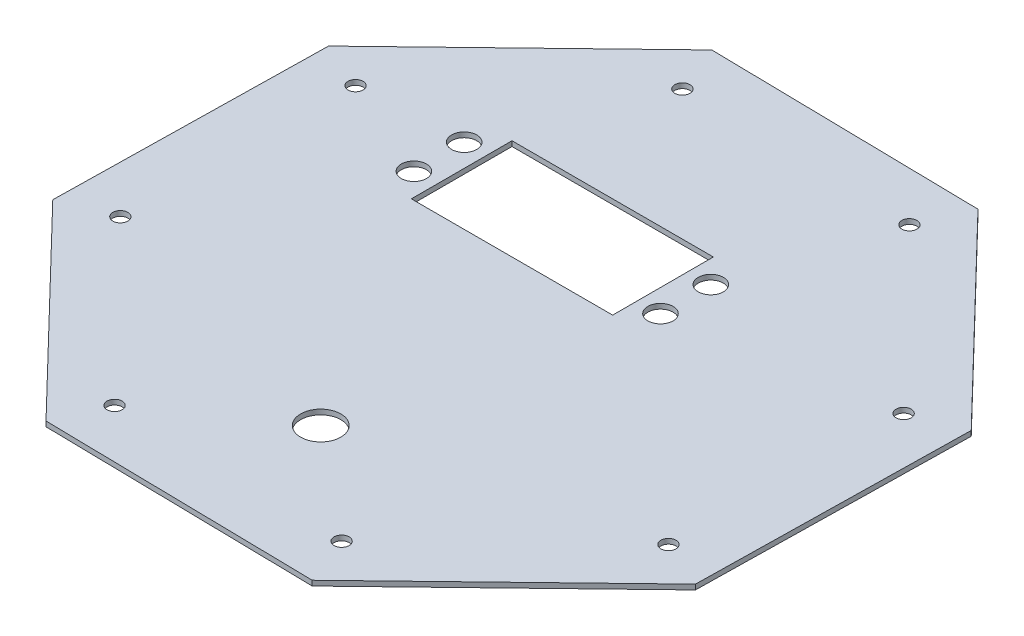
ISO-10303-21;
HEADER;
FILE_DESCRIPTION(('STEP AP214'),'2;1');
FILE_NAME('part.step','',(''),(''),'','','');
FILE_SCHEMA(('AUTOMOTIVE_DESIGN { 1 0 10303 214 1 1 1 1 }'));
ENDSEC;
DATA;
#1=APPLICATION_CONTEXT('core data for automotive mechanical design processes');
#2=APPLICATION_PROTOCOL_DEFINITION('international standard','automotive_design',2000,#1);
#3=PRODUCT_CONTEXT('',#1,'mechanical');
#4=PRODUCT('Part','Part','',(#3));
#5=PRODUCT_RELATED_PRODUCT_CATEGORY('part','',(#4));
#6=PRODUCT_DEFINITION_FORMATION('','',#4);
#7=PRODUCT_DEFINITION_CONTEXT('part definition',#1,'design');
#8=PRODUCT_DEFINITION('design','',#6,#7);
#9=PRODUCT_DEFINITION_SHAPE('','',#8);
#10=(LENGTH_UNIT() NAMED_UNIT(*) SI_UNIT(.MILLI.,.METRE.));
#11=(NAMED_UNIT(*) PLANE_ANGLE_UNIT() SI_UNIT($,.RADIAN.));
#12=(NAMED_UNIT(*) SI_UNIT($,.STERADIAN.) SOLID_ANGLE_UNIT());
#13=UNCERTAINTY_MEASURE_WITH_UNIT(LENGTH_MEASURE(1.E-05),#10,'distance_accuracy_value','');
#14=(GEOMETRIC_REPRESENTATION_CONTEXT(3) GLOBAL_UNCERTAINTY_ASSIGNED_CONTEXT((#13)) GLOBAL_UNIT_ASSIGNED_CONTEXT((#10,
#11,#12)) REPRESENTATION_CONTEXT('',''));
#15=CARTESIAN_POINT('',(0.,0.,0.));
#16=DIRECTION('',(0.,0.,1.));
#17=DIRECTION('',(1.,0.,0.));
#18=AXIS2_PLACEMENT_3D('',#15,#16,#17);
#19=CARTESIAN_POINT('',(0.,1.,0.));
#20=DIRECTION('',(0.,1.,0.));
#21=DIRECTION('',(0.,0.,1.));
#22=AXIS2_PLACEMENT_3D('',#19,#20,#21);
#23=PLANE('',#22);
#24=CARTESIAN_POINT('',(-34.5,1.,-15.));
#25=DIRECTION('',(0.,1.,0.));
#26=DIRECTION('',(0.,0.,1.));
#27=AXIS2_PLACEMENT_3D('',#24,#25,#26);
#28=CIRCLE('',#27,2.5);
#29=CARTESIAN_POINT('',(-34.5,1.,-12.5));
#30=VERTEX_POINT('',#29);
#31=EDGE_CURVE('E565',#30,#30,#28,.T.);
#32=ORIENTED_EDGE('',*,*,#31,.F.);
#33=EDGE_LOOP('',(#32));
#34=FACE_BOUND('',#33,.T.);
#35=CARTESIAN_POINT('',(14.5,1.,-25.));
#36=DIRECTION('',(0.,1.,0.));
#37=DIRECTION('',(0.,0.,1.));
#38=AXIS2_PLACEMENT_3D('',#35,#36,#37);
#39=CIRCLE('',#38,2.5);
#40=CARTESIAN_POINT('',(14.5,1.,-22.5));
#41=VERTEX_POINT('',#40);
#42=EDGE_CURVE('E563',#41,#41,#39,.T.);
#43=ORIENTED_EDGE('',*,*,#42,.F.);
#44=EDGE_LOOP('',(#43));
#45=FACE_BOUND('',#44,.T.);
#46=DIRECTION('',(0.,0.,-1.));
#47=VECTOR('',#46,1.);
#48=CARTESIAN_POINT('',(10.,1.,-10.));
#49=LINE('',#48,#47);
#50=CARTESIAN_POINT('',(10.,1.,-10.));
#51=VERTEX_POINT('',#50);
#52=CARTESIAN_POINT('',(10.,1.,-30.));
#53=VERTEX_POINT('',#52);
#54=EDGE_CURVE('E50',#51,#53,#49,.T.);
#55=ORIENTED_EDGE('',*,*,#54,.F.);
#56=DIRECTION('',(1.,0.,0.));
#57=VECTOR('',#56,1.);
#58=CARTESIAN_POINT('',(-30.,1.,-9.99999999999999));
#59=LINE('',#58,#57);
#60=CARTESIAN_POINT('',(-30.,1.,-9.99999999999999));
#61=VERTEX_POINT('',#60);
#62=EDGE_CURVE('E142',#61,#51,#59,.T.);
#63=ORIENTED_EDGE('',*,*,#62,.F.);
#64=DIRECTION('',(0.,0.,1.));
#65=VECTOR('',#64,1.);
#66=CARTESIAN_POINT('',(-30.,1.,-9.99999999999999));
#67=LINE('',#66,#65);
#68=CARTESIAN_POINT('',(-30.,1.,-30.));
#69=VERTEX_POINT('',#68);
#70=EDGE_CURVE('E127',#69,#61,#67,.T.);
#71=ORIENTED_EDGE('',*,*,#70,.F.);
#72=DIRECTION('',(-1.,0.,0.));
#73=VECTOR('',#72,1.);
#74=CARTESIAN_POINT('',(-30.,1.,-30.));
#75=LINE('',#74,#73);
#76=EDGE_CURVE('E136',#53,#69,#75,.T.);
#77=ORIENTED_EDGE('',*,*,#76,.F.);
#78=EDGE_LOOP('',(#55,#63,#71,#77));
#79=FACE_BOUND('',#78,.T.);
#80=CARTESIAN_POINT('',(0.,1.,38.));
#81=DIRECTION('',(0.,1.,0.));
#82=DIRECTION('',(0.,0.,1.));
#83=AXIS2_PLACEMENT_3D('',#80,#81,#82);
#84=CIRCLE('',#83,4.);
#85=CARTESIAN_POINT('',(0.,1.,42.));
#86=VERTEX_POINT('',#85);
#87=EDGE_CURVE('E149',#86,#86,#84,.T.);
#88=ORIENTED_EDGE('',*,*,#87,.F.);
#89=EDGE_LOOP('',(#88));
#90=FACE_BOUND('',#89,.T.);
#91=CARTESIAN_POINT('',(-34.5,1.,-25.));
#92=DIRECTION('',(0.,1.,0.));
#93=DIRECTION('',(0.,0.,1.));
#94=AXIS2_PLACEMENT_3D('',#91,#92,#93);
#95=CIRCLE('',#94,2.5);
#96=CARTESIAN_POINT('',(-34.5,1.,-22.5));
#97=VERTEX_POINT('',#96);
#98=EDGE_CURVE('E570',#97,#97,#95,.T.);
#99=ORIENTED_EDGE('',*,*,#98,.F.);
#100=EDGE_LOOP('',(#99));
#101=FACE_BOUND('',#100,.T.);
#102=CARTESIAN_POINT('',(14.5,1.,-15.));
#103=DIRECTION('',(0.,1.,0.));
#104=DIRECTION('',(0.,0.,1.));
#105=AXIS2_PLACEMENT_3D('',#102,#103,#104);
#106=CIRCLE('',#105,2.5);
#107=CARTESIAN_POINT('',(14.5,1.,-12.5));
#108=VERTEX_POINT('',#107);
#109=EDGE_CURVE('E152',#108,#108,#106,.T.);
#110=ORIENTED_EDGE('',*,*,#109,.F.);
#111=EDGE_LOOP('',(#110));
#112=FACE_BOUND('',#111,.T.);
#113=CARTESIAN_POINT('',(21.9771472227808,1.,55.8301441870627));
#114=DIRECTION('',(0.,1.,0.));
#115=DIRECTION('',(0.,0.,1.));
#116=AXIS2_PLACEMENT_3D('',#113,#114,#115);
#117=CIRCLE('',#116,1.5);
#118=CARTESIAN_POINT('',(21.9771472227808,1.,57.3301441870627));
#119=VERTEX_POINT('',#118);
#120=EDGE_CURVE('E163',#119,#119,#117,.T.);
#121=ORIENTED_EDGE('',*,*,#120,.F.);
#122=EDGE_LOOP('',(#121));
#123=FACE_BOUND('',#122,.T.);
#124=CARTESIAN_POINT('',(55.8301441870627,1.,-21.9771472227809));
#125=DIRECTION('',(0.,1.,0.));
#126=DIRECTION('',(0.,0.,1.));
#127=AXIS2_PLACEMENT_3D('',#124,#125,#126);
#128=CIRCLE('',#127,1.5);
#129=CARTESIAN_POINT('',(55.8301441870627,1.,-20.4771472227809));
#130=VERTEX_POINT('',#129);
#131=EDGE_CURVE('E175',#130,#130,#128,.T.);
#132=ORIENTED_EDGE('',*,*,#131,.F.);
#133=EDGE_LOOP('',(#132));
#134=FACE_BOUND('',#133,.T.);
#135=CARTESIAN_POINT('',(-21.9771472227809,1.,-55.8301441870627));
#136=DIRECTION('',(0.,1.,0.));
#137=DIRECTION('',(0.,0.,1.));
#138=AXIS2_PLACEMENT_3D('',#135,#136,#137);
#139=CIRCLE('',#138,1.5);
#140=CARTESIAN_POINT('',(-21.9771472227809,1.,-54.3301441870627));
#141=VERTEX_POINT('',#140);
#142=EDGE_CURVE('E187',#141,#141,#139,.T.);
#143=ORIENTED_EDGE('',*,*,#142,.F.);
#144=EDGE_LOOP('',(#143));
#145=FACE_BOUND('',#144,.T.);
#146=CARTESIAN_POINT('',(-55.8301441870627,1.,21.9771472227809));
#147=DIRECTION('',(0.,1.,0.));
#148=DIRECTION('',(0.,0.,1.));
#149=AXIS2_PLACEMENT_3D('',#146,#147,#148);
#150=CIRCLE('',#149,1.5);
#151=CARTESIAN_POINT('',(-55.8301441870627,1.,23.4771472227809));
#152=VERTEX_POINT('',#151);
#153=EDGE_CURVE('E199',#152,#152,#150,.T.);
#154=ORIENTED_EDGE('',*,*,#153,.F.);
#155=EDGE_LOOP('',(#154));
#156=FACE_BOUND('',#155,.T.);
#157=DIRECTION('',(0.999843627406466,0.,0.017683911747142));
#158=VECTOR('',#157,1.);
#159=CARTESIAN_POINT('',(-28.0691256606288,1.,64.5137162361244));
#160=LINE('',#159,#158);
#161=CARTESIAN_POINT('',(-28.0691256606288,1.,64.5137162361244));
#162=VERTEX_POINT('',#161);
#163=CARTESIAN_POINT('',(25.7702171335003,1.,65.4659553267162));
#164=VERTEX_POINT('',#163);
#165=EDGE_CURVE('E205',#162,#164,#160,.T.);
#166=ORIENTED_EDGE('',*,*,#165,.T.);
#167=DIRECTION('',(0.719500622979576,0.,-0.694491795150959));
#168=VECTOR('',#167,1.);
#169=CARTESIAN_POINT('',(25.7702171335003,1.,65.4659553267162));
#170=LINE('',#169,#168);
#171=CARTESIAN_POINT('',(64.5137162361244,1.,28.0691256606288));
#172=VERTEX_POINT('',#171);
#173=EDGE_CURVE('E208',#164,#172,#170,.T.);
#174=ORIENTED_EDGE('',*,*,#173,.T.);
#175=DIRECTION('',(0.017683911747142,0.,-0.999843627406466));
#176=VECTOR('',#175,1.);
#177=CARTESIAN_POINT('',(64.5137162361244,1.,28.0691256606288));
#178=LINE('',#177,#176);
#179=CARTESIAN_POINT('',(65.4659553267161,1.,-25.7702171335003));
#180=VERTEX_POINT('',#179);
#181=EDGE_CURVE('E211',#172,#180,#178,.T.);
#182=ORIENTED_EDGE('',*,*,#181,.T.);
#183=DIRECTION('',(-0.694491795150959,0.,-0.719500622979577));
#184=VECTOR('',#183,1.);
#185=CARTESIAN_POINT('',(65.4659553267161,1.,-25.7702171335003));
#186=LINE('',#185,#184);
#187=CARTESIAN_POINT('',(28.0691256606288,1.,-64.5137162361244));
#188=VERTEX_POINT('',#187);
#189=EDGE_CURVE('E213',#180,#188,#186,.T.);
#190=ORIENTED_EDGE('',*,*,#189,.T.);
#191=DIRECTION('',(-0.999843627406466,0.,-0.0176839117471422));
#192=VECTOR('',#191,1.);
#193=CARTESIAN_POINT('',(28.0691256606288,1.,-64.5137162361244));
#194=LINE('',#193,#192);
#195=CARTESIAN_POINT('',(-25.7702171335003,1.,-65.4659553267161));
#196=VERTEX_POINT('',#195);
#197=EDGE_CURVE('E215',#188,#196,#194,.T.);
#198=ORIENTED_EDGE('',*,*,#197,.T.);
#199=DIRECTION('',(-0.719500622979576,0.,0.694491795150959));
#200=VECTOR('',#199,1.);
#201=CARTESIAN_POINT('',(-25.7702171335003,1.,-65.4659553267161));
#202=LINE('',#201,#200);
#203=CARTESIAN_POINT('',(-64.5137162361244,1.,-28.0691256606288));
#204=VERTEX_POINT('',#203);
#205=EDGE_CURVE('E217',#196,#204,#202,.T.);
#206=ORIENTED_EDGE('',*,*,#205,.T.);
#207=DIRECTION('',(-0.017683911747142,0.,0.999843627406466));
#208=VECTOR('',#207,1.);
#209=CARTESIAN_POINT('',(-64.5137162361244,1.,-28.0691256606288));
#210=LINE('',#209,#208);
#211=CARTESIAN_POINT('',(-65.4659553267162,1.,25.7702171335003));
#212=VERTEX_POINT('',#211);
#213=EDGE_CURVE('E219',#204,#212,#210,.T.);
#214=ORIENTED_EDGE('',*,*,#213,.T.);
#215=DIRECTION('',(0.694491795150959,0.,0.719500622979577));
#216=VECTOR('',#215,1.);
#217=CARTESIAN_POINT('',(-65.4659553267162,1.,25.7702171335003));
#218=LINE('',#217,#216);
#219=EDGE_CURVE('E221',#212,#162,#218,.T.);
#220=ORIENTED_EDGE('',*,*,#219,.T.);
#221=EDGE_LOOP('',(#166,#174,#182,#190,#198,#206,#214,#220));
#222=FACE_BOUND('',#221,.T.);
#223=CARTESIAN_POINT('',(-55.0180633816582,1.,-23.9376837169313));
#224=DIRECTION('',(0.,1.,0.));
#225=DIRECTION('',(0.,0.,1.));
#226=AXIS2_PLACEMENT_3D('',#223,#224,#225);
#227=CIRCLE('',#226,1.5);
#228=CARTESIAN_POINT('',(-55.0180633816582,1.,-22.4376837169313));
#229=VERTEX_POINT('',#228);
#230=EDGE_CURVE('E193',#229,#229,#227,.T.);
#231=ORIENTED_EDGE('',*,*,#230,.F.);
#232=EDGE_LOOP('',(#231));
#233=FACE_BOUND('',#232,.T.);
#234=CARTESIAN_POINT('',(23.9376837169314,1.,-55.0180633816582));
#235=DIRECTION('',(0.,1.,0.));
#236=DIRECTION('',(0.,0.,1.));
#237=AXIS2_PLACEMENT_3D('',#234,#235,#236);
#238=CIRCLE('',#237,1.5);
#239=CARTESIAN_POINT('',(23.9376837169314,1.,-53.5180633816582));
#240=VERTEX_POINT('',#239);
#241=EDGE_CURVE('E181',#240,#240,#238,.T.);
#242=ORIENTED_EDGE('',*,*,#241,.F.);
#243=EDGE_LOOP('',(#242));
#244=FACE_BOUND('',#243,.T.);
#245=CARTESIAN_POINT('',(55.0180633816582,1.,23.9376837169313));
#246=DIRECTION('',(0.,1.,0.));
#247=DIRECTION('',(0.,0.,1.));
#248=AXIS2_PLACEMENT_3D('',#245,#246,#247);
#249=CIRCLE('',#248,1.5);
#250=CARTESIAN_POINT('',(55.0180633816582,1.,25.4376837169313));
#251=VERTEX_POINT('',#250);
#252=EDGE_CURVE('E169',#251,#251,#249,.T.);
#253=ORIENTED_EDGE('',*,*,#252,.F.);
#254=EDGE_LOOP('',(#253));
#255=FACE_BOUND('',#254,.T.);
#256=CARTESIAN_POINT('',(-23.9376837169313,1.,55.0180633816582));
#257=DIRECTION('',(0.,1.,0.));
#258=DIRECTION('',(0.,0.,1.));
#259=AXIS2_PLACEMENT_3D('',#256,#257,#258);
#260=CIRCLE('',#259,1.5);
#261=CARTESIAN_POINT('',(-23.9376837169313,1.,56.5180633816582));
#262=VERTEX_POINT('',#261);
#263=EDGE_CURVE('E156',#262,#262,#260,.T.);
#264=ORIENTED_EDGE('',*,*,#263,.F.);
#265=EDGE_LOOP('',(#264));
#266=FACE_BOUND('',#265,.T.);
#267=ADVANCED_FACE('F33',(#34,#45,#79,#90,#101,#112,#123,#134,#145,#156,#222,#233,#244,#255,
#266),#23,.T.);
#268=CARTESIAN_POINT('',(0.,0.,0.));
#269=DIRECTION('',(0.,1.,0.));
#270=DIRECTION('',(0.,0.,1.));
#271=AXIS2_PLACEMENT_3D('',#268,#269,#270);
#272=PLANE('',#271);
#273=CARTESIAN_POINT('',(-34.5,0.,-15.));
#274=DIRECTION('',(0.,1.,0.));
#275=DIRECTION('',(0.,0.,1.));
#276=AXIS2_PLACEMENT_3D('',#273,#274,#275);
#277=CIRCLE('',#276,2.5);
#278=CARTESIAN_POINT('',(-34.5,0.,-12.5));
#279=VERTEX_POINT('',#278);
#280=EDGE_CURVE('E37',#279,#279,#277,.T.);
#281=ORIENTED_EDGE('',*,*,#280,.T.);
#282=EDGE_LOOP('',(#281));
#283=FACE_BOUND('',#282,.T.);
#284=CARTESIAN_POINT('',(14.5,0.,-25.));
#285=DIRECTION('',(0.,1.,0.));
#286=DIRECTION('',(0.,0.,1.));
#287=AXIS2_PLACEMENT_3D('',#284,#285,#286);
#288=CIRCLE('',#287,2.5);
#289=CARTESIAN_POINT('',(14.5,0.,-22.5));
#290=VERTEX_POINT('',#289);
#291=EDGE_CURVE('E271',#290,#290,#288,.T.);
#292=ORIENTED_EDGE('',*,*,#291,.T.);
#293=EDGE_LOOP('',(#292));
#294=FACE_BOUND('',#293,.T.);
#295=DIRECTION('',(1.,0.,0.));
#296=VECTOR('',#295,1.);
#297=CARTESIAN_POINT('',(0.,0.,-10.));
#298=LINE('',#297,#296);
#299=CARTESIAN_POINT('',(-30.,0.,-9.99999999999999));
#300=VERTEX_POINT('',#299);
#301=CARTESIAN_POINT('',(10.,0.,-10.));
#302=VERTEX_POINT('',#301);
#303=EDGE_CURVE('E42',#300,#302,#298,.T.);
#304=ORIENTED_EDGE('',*,*,#303,.T.);
#305=DIRECTION('',(0.,0.,-1.));
#306=VECTOR('',#305,1.);
#307=CARTESIAN_POINT('',(10.,0.,0.));
#308=LINE('',#307,#306);
#309=CARTESIAN_POINT('',(10.,0.,-30.));
#310=VERTEX_POINT('',#309);
#311=EDGE_CURVE('E11',#302,#310,#308,.T.);
#312=ORIENTED_EDGE('',*,*,#311,.T.);
#313=DIRECTION('',(-1.,0.,0.));
#314=VECTOR('',#313,1.);
#315=CARTESIAN_POINT('',(0.,0.,-30.));
#316=LINE('',#315,#314);
#317=CARTESIAN_POINT('',(-30.,0.,-30.));
#318=VERTEX_POINT('',#317);
#319=EDGE_CURVE('E262',#310,#318,#316,.T.);
#320=ORIENTED_EDGE('',*,*,#319,.T.);
#321=DIRECTION('',(0.,0.,1.));
#322=VECTOR('',#321,1.);
#323=CARTESIAN_POINT('',(-30.,0.,0.));
#324=LINE('',#323,#322);
#325=EDGE_CURVE('E130',#318,#300,#324,.T.);
#326=ORIENTED_EDGE('',*,*,#325,.T.);
#327=EDGE_LOOP('',(#304,#312,#320,#326));
#328=FACE_BOUND('',#327,.T.);
#329=CARTESIAN_POINT('',(0.,0.,38.));
#330=DIRECTION('',(0.,1.,0.));
#331=DIRECTION('',(0.,0.,1.));
#332=AXIS2_PLACEMENT_3D('',#329,#330,#331);
#333=CIRCLE('',#332,4.);
#334=CARTESIAN_POINT('',(0.,0.,42.));
#335=VERTEX_POINT('',#334);
#336=EDGE_CURVE('E268',#335,#335,#333,.T.);
#337=ORIENTED_EDGE('',*,*,#336,.T.);
#338=EDGE_LOOP('',(#337));
#339=FACE_BOUND('',#338,.T.);
#340=CARTESIAN_POINT('',(-34.5,0.,-25.));
#341=DIRECTION('',(0.,1.,0.));
#342=DIRECTION('',(0.,0.,1.));
#343=AXIS2_PLACEMENT_3D('',#340,#341,#342);
#344=CIRCLE('',#343,2.5);
#345=CARTESIAN_POINT('',(-34.5,0.,-22.5));
#346=VERTEX_POINT('',#345);
#347=EDGE_CURVE('E265',#346,#346,#344,.T.);
#348=ORIENTED_EDGE('',*,*,#347,.T.);
#349=EDGE_LOOP('',(#348));
#350=FACE_BOUND('',#349,.T.);
#351=CARTESIAN_POINT('',(14.5,0.,-15.));
#352=DIRECTION('',(0.,1.,0.));
#353=DIRECTION('',(0.,0.,1.));
#354=AXIS2_PLACEMENT_3D('',#351,#352,#353);
#355=CIRCLE('',#354,2.5);
#356=CARTESIAN_POINT('',(14.5,0.,-12.5));
#357=VERTEX_POINT('',#356);
#358=EDGE_CURVE('E155',#357,#357,#355,.T.);
#359=ORIENTED_EDGE('',*,*,#358,.T.);
#360=EDGE_LOOP('',(#359));
#361=FACE_BOUND('',#360,.T.);
#362=DIRECTION('',(0.999843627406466,0.,0.017683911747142));
#363=VECTOR('',#362,1.);
#364=CARTESIAN_POINT('',(-28.0691256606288,0.,64.5137162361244));
#365=LINE('',#364,#363);
#366=CARTESIAN_POINT('',(-28.0691256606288,0.,64.5137162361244));
#367=VERTEX_POINT('',#366);
#368=CARTESIAN_POINT('',(25.7702171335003,0.,65.4659553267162));
#369=VERTEX_POINT('',#368);
#370=EDGE_CURVE('E202',#367,#369,#365,.T.);
#371=ORIENTED_EDGE('',*,*,#370,.F.);
#372=DIRECTION('',(0.694491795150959,0.,0.719500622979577));
#373=VECTOR('',#372,1.);
#374=CARTESIAN_POINT('',(-65.4659553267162,0.,25.7702171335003));
#375=LINE('',#374,#373);
#376=CARTESIAN_POINT('',(-65.4659553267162,0.,25.7702171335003));
#377=VERTEX_POINT('',#376);
#378=EDGE_CURVE('E209',#377,#367,#375,.T.);
#379=ORIENTED_EDGE('',*,*,#378,.F.);
#380=DIRECTION('',(-0.017683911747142,0.,0.999843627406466));
#381=VECTOR('',#380,1.);
#382=CARTESIAN_POINT('',(-64.5137162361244,0.,-28.0691256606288));
#383=LINE('',#382,#381);
#384=CARTESIAN_POINT('',(-64.5137162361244,0.,-28.0691256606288));
#385=VERTEX_POINT('',#384);
#386=EDGE_CURVE('E236',#385,#377,#383,.T.);
#387=ORIENTED_EDGE('',*,*,#386,.F.);
#388=DIRECTION('',(-0.719500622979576,0.,0.694491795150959));
#389=VECTOR('',#388,1.);
#390=CARTESIAN_POINT('',(-25.7702171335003,0.,-65.4659553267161));
#391=LINE('',#390,#389);
#392=CARTESIAN_POINT('',(-25.7702171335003,0.,-65.4659553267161));
#393=VERTEX_POINT('',#392);
#394=EDGE_CURVE('E234',#393,#385,#391,.T.);
#395=ORIENTED_EDGE('',*,*,#394,.F.);
#396=DIRECTION('',(-0.999843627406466,0.,-0.0176839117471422));
#397=VECTOR('',#396,1.);
#398=CARTESIAN_POINT('',(28.0691256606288,0.,-64.5137162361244));
#399=LINE('',#398,#397);
#400=CARTESIAN_POINT('',(28.0691256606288,0.,-64.5137162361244));
#401=VERTEX_POINT('',#400);
#402=EDGE_CURVE('E232',#401,#393,#399,.T.);
#403=ORIENTED_EDGE('',*,*,#402,.F.);
#404=DIRECTION('',(-0.694491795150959,0.,-0.719500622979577));
#405=VECTOR('',#404,1.);
#406=CARTESIAN_POINT('',(65.4659553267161,0.,-25.7702171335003));
#407=LINE('',#406,#405);
#408=CARTESIAN_POINT('',(65.4659553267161,0.,-25.7702171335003));
#409=VERTEX_POINT('',#408);
#410=EDGE_CURVE('E230',#409,#401,#407,.T.);
#411=ORIENTED_EDGE('',*,*,#410,.F.);
#412=DIRECTION('',(0.017683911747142,0.,-0.999843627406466));
#413=VECTOR('',#412,1.);
#414=CARTESIAN_POINT('',(64.5137162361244,0.,28.0691256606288));
#415=LINE('',#414,#413);
#416=CARTESIAN_POINT('',(64.5137162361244,0.,28.0691256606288));
#417=VERTEX_POINT('',#416);
#418=EDGE_CURVE('E228',#417,#409,#415,.T.);
#419=ORIENTED_EDGE('',*,*,#418,.F.);
#420=DIRECTION('',(0.719500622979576,0.,-0.694491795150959));
#421=VECTOR('',#420,1.);
#422=CARTESIAN_POINT('',(25.7702171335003,0.,65.4659553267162));
#423=LINE('',#422,#421);
#424=EDGE_CURVE('E226',#369,#417,#423,.T.);
#425=ORIENTED_EDGE('',*,*,#424,.F.);
#426=EDGE_LOOP('',(#371,#379,#387,#395,#403,#411,#419,#425));
#427=FACE_BOUND('',#426,.T.);
#428=CARTESIAN_POINT('',(-55.8301441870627,0.,21.9771472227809));
#429=DIRECTION('',(0.,1.,0.));
#430=DIRECTION('',(0.,0.,1.));
#431=AXIS2_PLACEMENT_3D('',#428,#429,#430);
#432=CIRCLE('',#431,1.5);
#433=CARTESIAN_POINT('',(-55.8301441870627,0.,23.4771472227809));
#434=VERTEX_POINT('',#433);
#435=EDGE_CURVE('E196',#434,#434,#432,.T.);
#436=ORIENTED_EDGE('',*,*,#435,.T.);
#437=EDGE_LOOP('',(#436));
#438=FACE_BOUND('',#437,.T.);
#439=CARTESIAN_POINT('',(-55.0180633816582,0.,-23.9376837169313));
#440=DIRECTION('',(0.,1.,0.));
#441=DIRECTION('',(0.,0.,1.));
#442=AXIS2_PLACEMENT_3D('',#439,#440,#441);
#443=CIRCLE('',#442,1.5);
#444=CARTESIAN_POINT('',(-55.0180633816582,0.,-22.4376837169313));
#445=VERTEX_POINT('',#444);
#446=EDGE_CURVE('E190',#445,#445,#443,.T.);
#447=ORIENTED_EDGE('',*,*,#446,.T.);
#448=EDGE_LOOP('',(#447));
#449=FACE_BOUND('',#448,.T.);
#450=CARTESIAN_POINT('',(-21.9771472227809,0.,-55.8301441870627));
#451=DIRECTION('',(0.,1.,0.));
#452=DIRECTION('',(0.,0.,1.));
#453=AXIS2_PLACEMENT_3D('',#450,#451,#452);
#454=CIRCLE('',#453,1.5);
#455=CARTESIAN_POINT('',(-21.9771472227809,0.,-54.3301441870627));
#456=VERTEX_POINT('',#455);
#457=EDGE_CURVE('E184',#456,#456,#454,.T.);
#458=ORIENTED_EDGE('',*,*,#457,.T.);
#459=EDGE_LOOP('',(#458));
#460=FACE_BOUND('',#459,.T.);
#461=CARTESIAN_POINT('',(23.9376837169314,0.,-55.0180633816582));
#462=DIRECTION('',(0.,1.,0.));
#463=DIRECTION('',(0.,0.,1.));
#464=AXIS2_PLACEMENT_3D('',#461,#462,#463);
#465=CIRCLE('',#464,1.5);
#466=CARTESIAN_POINT('',(23.9376837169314,0.,-53.5180633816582));
#467=VERTEX_POINT('',#466);
#468=EDGE_CURVE('E178',#467,#467,#465,.T.);
#469=ORIENTED_EDGE('',*,*,#468,.T.);
#470=EDGE_LOOP('',(#469));
#471=FACE_BOUND('',#470,.T.);
#472=CARTESIAN_POINT('',(55.8301441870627,0.,-21.9771472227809));
#473=DIRECTION('',(0.,1.,0.));
#474=DIRECTION('',(0.,0.,1.));
#475=AXIS2_PLACEMENT_3D('',#472,#473,#474);
#476=CIRCLE('',#475,1.5);
#477=CARTESIAN_POINT('',(55.8301441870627,0.,-20.4771472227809));
#478=VERTEX_POINT('',#477);
#479=EDGE_CURVE('E172',#478,#478,#476,.T.);
#480=ORIENTED_EDGE('',*,*,#479,.T.);
#481=EDGE_LOOP('',(#480));
#482=FACE_BOUND('',#481,.T.);
#483=CARTESIAN_POINT('',(55.0180633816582,0.,23.9376837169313));
#484=DIRECTION('',(0.,1.,0.));
#485=DIRECTION('',(0.,0.,1.));
#486=AXIS2_PLACEMENT_3D('',#483,#484,#485);
#487=CIRCLE('',#486,1.5);
#488=CARTESIAN_POINT('',(55.0180633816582,0.,25.4376837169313));
#489=VERTEX_POINT('',#488);
#490=EDGE_CURVE('E166',#489,#489,#487,.T.);
#491=ORIENTED_EDGE('',*,*,#490,.T.);
#492=EDGE_LOOP('',(#491));
#493=FACE_BOUND('',#492,.T.);
#494=CARTESIAN_POINT('',(21.9771472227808,0.,55.8301441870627));
#495=DIRECTION('',(0.,1.,0.));
#496=DIRECTION('',(0.,0.,1.));
#497=AXIS2_PLACEMENT_3D('',#494,#495,#496);
#498=CIRCLE('',#497,1.5);
#499=CARTESIAN_POINT('',(21.9771472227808,0.,57.3301441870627));
#500=VERTEX_POINT('',#499);
#501=EDGE_CURVE('E159',#500,#500,#498,.T.);
#502=ORIENTED_EDGE('',*,*,#501,.T.);
#503=EDGE_LOOP('',(#502));
#504=FACE_BOUND('',#503,.T.);
#505=CARTESIAN_POINT('',(-23.9376837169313,0.,55.0180633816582));
#506=DIRECTION('',(0.,1.,0.));
#507=DIRECTION('',(0.,0.,1.));
#508=AXIS2_PLACEMENT_3D('',#505,#506,#507);
#509=CIRCLE('',#508,1.5);
#510=CARTESIAN_POINT('',(-23.9376837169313,0.,56.5180633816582));
#511=VERTEX_POINT('',#510);
#512=EDGE_CURVE('E160',#511,#511,#509,.T.);
#513=ORIENTED_EDGE('',*,*,#512,.T.);
#514=EDGE_LOOP('',(#513));
#515=FACE_BOUND('',#514,.T.);
#516=ADVANCED_FACE('F281',(#283,#294,#328,#339,#350,#361,#427,#438,#449,#460,#471,#482,#493,
#504,#515),#272,.F.);
#517=CARTESIAN_POINT('',(-28.0691256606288,1.,64.5137162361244));
#518=DIRECTION('',(0.017683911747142,0.,-0.999843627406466));
#519=DIRECTION('',(-0.999843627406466,0.,-0.017683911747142));
#520=AXIS2_PLACEMENT_3D('',#517,#518,#519);
#521=PLANE('',#520);
#522=ORIENTED_EDGE('',*,*,#370,.T.);
#523=DIRECTION('',(0.,-1.,0.));
#524=VECTOR('',#523,1.);
#525=CARTESIAN_POINT('',(25.7702171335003,1.,65.4659553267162));
#526=LINE('',#525,#524);
#527=EDGE_CURVE('E259',#164,#369,#526,.T.);
#528=ORIENTED_EDGE('',*,*,#527,.F.);
#529=ORIENTED_EDGE('',*,*,#165,.F.);
#530=DIRECTION('',(0.,-1.,0.));
#531=VECTOR('',#530,1.);
#532=CARTESIAN_POINT('',(-28.0691256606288,1.,64.5137162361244));
#533=LINE('',#532,#531);
#534=EDGE_CURVE('E223',#162,#367,#533,.T.);
#535=ORIENTED_EDGE('',*,*,#534,.T.);
#536=EDGE_LOOP('',(#522,#528,#529,#535));
#537=FACE_BOUND('',#536,.T.);
#538=ADVANCED_FACE('F35',(#537),#521,.F.);
#539=CARTESIAN_POINT('',(25.7702171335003,1.,65.4659553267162));
#540=DIRECTION('',(-0.694491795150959,0.,-0.719500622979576));
#541=DIRECTION('',(-0.719500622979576,0.,0.694491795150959));
#542=AXIS2_PLACEMENT_3D('',#539,#540,#541);
#543=PLANE('',#542);
#544=ORIENTED_EDGE('',*,*,#424,.T.);
#545=DIRECTION('',(0.,-1.,0.));
#546=VECTOR('',#545,1.);
#547=CARTESIAN_POINT('',(64.5137162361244,1.,28.0691256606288));
#548=LINE('',#547,#546);
#549=EDGE_CURVE('E256',#172,#417,#548,.T.);
#550=ORIENTED_EDGE('',*,*,#549,.F.);
#551=ORIENTED_EDGE('',*,*,#173,.F.);
#552=ORIENTED_EDGE('',*,*,#527,.T.);
#553=EDGE_LOOP('',(#544,#550,#551,#552));
#554=FACE_BOUND('',#553,.T.);
#555=ADVANCED_FACE('F330',(#554),#543,.F.);
#556=CARTESIAN_POINT('',(64.5137162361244,1.,28.0691256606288));
#557=DIRECTION('',(-0.999843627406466,0.,-0.017683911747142));
#558=DIRECTION('',(-0.017683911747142,0.,0.999843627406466));
#559=AXIS2_PLACEMENT_3D('',#556,#557,#558);
#560=PLANE('',#559);
#561=ORIENTED_EDGE('',*,*,#418,.T.);
#562=DIRECTION('',(0.,-1.,0.));
#563=VECTOR('',#562,1.);
#564=CARTESIAN_POINT('',(65.4659553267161,1.,-25.7702171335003));
#565=LINE('',#564,#563);
#566=EDGE_CURVE('E253',#180,#409,#565,.T.);
#567=ORIENTED_EDGE('',*,*,#566,.F.);
#568=ORIENTED_EDGE('',*,*,#181,.F.);
#569=ORIENTED_EDGE('',*,*,#549,.T.);
#570=EDGE_LOOP('',(#561,#567,#568,#569));
#571=FACE_BOUND('',#570,.T.);
#572=ADVANCED_FACE('F327',(#571),#560,.F.);
#573=CARTESIAN_POINT('',(65.4659553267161,1.,-25.7702171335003));
#574=DIRECTION('',(-0.719500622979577,0.,0.694491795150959));
#575=DIRECTION('',(0.694491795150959,0.,0.719500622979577));
#576=AXIS2_PLACEMENT_3D('',#573,#574,#575);
#577=PLANE('',#576);
#578=ORIENTED_EDGE('',*,*,#410,.T.);
#579=DIRECTION('',(0.,-1.,0.));
#580=VECTOR('',#579,1.);
#581=CARTESIAN_POINT('',(28.0691256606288,1.,-64.5137162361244));
#582=LINE('',#581,#580);
#583=EDGE_CURVE('E250',#188,#401,#582,.T.);
#584=ORIENTED_EDGE('',*,*,#583,.F.);
#585=ORIENTED_EDGE('',*,*,#189,.F.);
#586=ORIENTED_EDGE('',*,*,#566,.T.);
#587=EDGE_LOOP('',(#578,#584,#585,#586));
#588=FACE_BOUND('',#587,.T.);
#589=ADVANCED_FACE('F323',(#588),#577,.F.);
#590=CARTESIAN_POINT('',(28.0691256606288,1.,-64.5137162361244));
#591=DIRECTION('',(-0.0176839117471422,0.,0.999843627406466));
#592=DIRECTION('',(0.999843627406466,0.,0.0176839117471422));
#593=AXIS2_PLACEMENT_3D('',#590,#591,#592);
#594=PLANE('',#593);
#595=ORIENTED_EDGE('',*,*,#402,.T.);
#596=DIRECTION('',(0.,-1.,0.));
#597=VECTOR('',#596,1.);
#598=CARTESIAN_POINT('',(-25.7702171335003,1.,-65.4659553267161));
#599=LINE('',#598,#597);
#600=EDGE_CURVE('E247',#196,#393,#599,.T.);
#601=ORIENTED_EDGE('',*,*,#600,.F.);
#602=ORIENTED_EDGE('',*,*,#197,.F.);
#603=ORIENTED_EDGE('',*,*,#583,.T.);
#604=EDGE_LOOP('',(#595,#601,#602,#603));
#605=FACE_BOUND('',#604,.T.);
#606=ADVANCED_FACE('F319',(#605),#594,.F.);
#607=CARTESIAN_POINT('',(-25.7702171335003,1.,-65.4659553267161));
#608=DIRECTION('',(0.694491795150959,0.,0.719500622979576));
#609=DIRECTION('',(0.719500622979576,0.,-0.694491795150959));
#610=AXIS2_PLACEMENT_3D('',#607,#608,#609);
#611=PLANE('',#610);
#612=ORIENTED_EDGE('',*,*,#394,.T.);
#613=DIRECTION('',(0.,-1.,0.));
#614=VECTOR('',#613,1.);
#615=CARTESIAN_POINT('',(-64.5137162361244,1.,-28.0691256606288));
#616=LINE('',#615,#614);
#617=EDGE_CURVE('E244',#204,#385,#616,.T.);
#618=ORIENTED_EDGE('',*,*,#617,.F.);
#619=ORIENTED_EDGE('',*,*,#205,.F.);
#620=ORIENTED_EDGE('',*,*,#600,.T.);
#621=EDGE_LOOP('',(#612,#618,#619,#620));
#622=FACE_BOUND('',#621,.T.);
#623=ADVANCED_FACE('F315',(#622),#611,.F.);
#624=CARTESIAN_POINT('',(-64.5137162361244,1.,-28.0691256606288));
#625=DIRECTION('',(0.999843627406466,0.,0.017683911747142));
#626=DIRECTION('',(0.017683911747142,0.,-0.999843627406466));
#627=AXIS2_PLACEMENT_3D('',#624,#625,#626);
#628=PLANE('',#627);
#629=ORIENTED_EDGE('',*,*,#386,.T.);
#630=DIRECTION('',(0.,-1.,0.));
#631=VECTOR('',#630,1.);
#632=CARTESIAN_POINT('',(-65.4659553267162,1.,25.7702171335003));
#633=LINE('',#632,#631);
#634=EDGE_CURVE('E241',#212,#377,#633,.T.);
#635=ORIENTED_EDGE('',*,*,#634,.F.);
#636=ORIENTED_EDGE('',*,*,#213,.F.);
#637=ORIENTED_EDGE('',*,*,#617,.T.);
#638=EDGE_LOOP('',(#629,#635,#636,#637));
#639=FACE_BOUND('',#638,.T.);
#640=ADVANCED_FACE('F311',(#639),#628,.F.);
#641=CARTESIAN_POINT('',(-65.4659553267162,1.,25.7702171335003));
#642=DIRECTION('',(0.719500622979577,0.,-0.694491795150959));
#643=DIRECTION('',(-0.694491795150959,0.,-0.719500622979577));
#644=AXIS2_PLACEMENT_3D('',#641,#642,#643);
#645=PLANE('',#644);
#646=ORIENTED_EDGE('',*,*,#378,.T.);
#647=ORIENTED_EDGE('',*,*,#534,.F.);
#648=ORIENTED_EDGE('',*,*,#219,.F.);
#649=ORIENTED_EDGE('',*,*,#634,.T.);
#650=EDGE_LOOP('',(#646,#647,#648,#649));
#651=FACE_BOUND('',#650,.T.);
#652=ADVANCED_FACE('F308',(#651),#645,.F.);
#653=CARTESIAN_POINT('',(-55.8301441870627,1.,21.9771472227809));
#654=DIRECTION('',(0.,-1.,0.));
#655=DIRECTION('',(0.,0.,-1.));
#656=AXIS2_PLACEMENT_3D('',#653,#654,#655);
#657=CYLINDRICAL_SURFACE('',#656,1.5);
#658=ORIENTED_EDGE('',*,*,#153,.T.);
#659=EDGE_LOOP('',(#658));
#660=FACE_BOUND('',#659,.T.);
#661=ORIENTED_EDGE('',*,*,#435,.F.);
#662=EDGE_LOOP('',(#661));
#663=FACE_BOUND('',#662,.T.);
#664=ADVANCED_FACE('F305',(#660,#663),#657,.F.);
#665=CARTESIAN_POINT('',(-55.0180633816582,1.,-23.9376837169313));
#666=DIRECTION('',(0.,-1.,0.));
#667=DIRECTION('',(0.,0.,-1.));
#668=AXIS2_PLACEMENT_3D('',#665,#666,#667);
#669=CYLINDRICAL_SURFACE('',#668,1.5);
#670=ORIENTED_EDGE('',*,*,#230,.T.);
#671=EDGE_LOOP('',(#670));
#672=FACE_BOUND('',#671,.T.);
#673=ORIENTED_EDGE('',*,*,#446,.F.);
#674=EDGE_LOOP('',(#673));
#675=FACE_BOUND('',#674,.T.);
#676=ADVANCED_FACE('F405',(#672,#675),#669,.F.);
#677=CARTESIAN_POINT('',(-21.9771472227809,1.,-55.8301441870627));
#678=DIRECTION('',(0.,-1.,0.));
#679=DIRECTION('',(0.,0.,-1.));
#680=AXIS2_PLACEMENT_3D('',#677,#678,#679);
#681=CYLINDRICAL_SURFACE('',#680,1.5);
#682=ORIENTED_EDGE('',*,*,#142,.T.);
#683=EDGE_LOOP('',(#682));
#684=FACE_BOUND('',#683,.T.);
#685=ORIENTED_EDGE('',*,*,#457,.F.);
#686=EDGE_LOOP('',(#685));
#687=FACE_BOUND('',#686,.T.);
#688=ADVANCED_FACE('F402',(#684,#687),#681,.F.);
#689=CARTESIAN_POINT('',(23.9376837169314,1.,-55.0180633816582));
#690=DIRECTION('',(0.,-1.,0.));
#691=DIRECTION('',(0.,0.,-1.));
#692=AXIS2_PLACEMENT_3D('',#689,#690,#691);
#693=CYLINDRICAL_SURFACE('',#692,1.5);
#694=ORIENTED_EDGE('',*,*,#241,.T.);
#695=EDGE_LOOP('',(#694));
#696=FACE_BOUND('',#695,.T.);
#697=ORIENTED_EDGE('',*,*,#468,.F.);
#698=EDGE_LOOP('',(#697));
#699=FACE_BOUND('',#698,.T.);
#700=ADVANCED_FACE('F398',(#696,#699),#693,.F.);
#701=CARTESIAN_POINT('',(55.8301441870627,1.,-21.9771472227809));
#702=DIRECTION('',(0.,-1.,0.));
#703=DIRECTION('',(0.,0.,-1.));
#704=AXIS2_PLACEMENT_3D('',#701,#702,#703);
#705=CYLINDRICAL_SURFACE('',#704,1.5);
#706=ORIENTED_EDGE('',*,*,#131,.T.);
#707=EDGE_LOOP('',(#706));
#708=FACE_BOUND('',#707,.T.);
#709=ORIENTED_EDGE('',*,*,#479,.F.);
#710=EDGE_LOOP('',(#709));
#711=FACE_BOUND('',#710,.T.);
#712=ADVANCED_FACE('F394',(#708,#711),#705,.F.);
#713=CARTESIAN_POINT('',(55.0180633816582,1.,23.9376837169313));
#714=DIRECTION('',(0.,-1.,0.));
#715=DIRECTION('',(0.,0.,-1.));
#716=AXIS2_PLACEMENT_3D('',#713,#714,#715);
#717=CYLINDRICAL_SURFACE('',#716,1.5);
#718=ORIENTED_EDGE('',*,*,#252,.T.);
#719=EDGE_LOOP('',(#718));
#720=FACE_BOUND('',#719,.T.);
#721=ORIENTED_EDGE('',*,*,#490,.F.);
#722=EDGE_LOOP('',(#721));
#723=FACE_BOUND('',#722,.T.);
#724=ADVANCED_FACE('F387',(#720,#723),#717,.F.);
#725=CARTESIAN_POINT('',(21.9771472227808,1.,55.8301441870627));
#726=DIRECTION('',(0.,-1.,0.));
#727=DIRECTION('',(0.,0.,-1.));
#728=AXIS2_PLACEMENT_3D('',#725,#726,#727);
#729=CYLINDRICAL_SURFACE('',#728,1.5);
#730=ORIENTED_EDGE('',*,*,#120,.T.);
#731=EDGE_LOOP('',(#730));
#732=FACE_BOUND('',#731,.T.);
#733=ORIENTED_EDGE('',*,*,#501,.F.);
#734=EDGE_LOOP('',(#733));
#735=FACE_BOUND('',#734,.T.);
#736=ADVANCED_FACE('F376',(#732,#735),#729,.F.);
#737=CARTESIAN_POINT('',(-23.9376837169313,1.,55.0180633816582));
#738=DIRECTION('',(0.,-1.,0.));
#739=DIRECTION('',(0.,0.,-1.));
#740=AXIS2_PLACEMENT_3D('',#737,#738,#739);
#741=CYLINDRICAL_SURFACE('',#740,1.5);
#742=ORIENTED_EDGE('',*,*,#263,.T.);
#743=EDGE_LOOP('',(#742));
#744=FACE_BOUND('',#743,.T.);
#745=ORIENTED_EDGE('',*,*,#512,.F.);
#746=EDGE_LOOP('',(#745));
#747=FACE_BOUND('',#746,.T.);
#748=ADVANCED_FACE('F372',(#744,#747),#741,.F.);
#749=CARTESIAN_POINT('',(14.5,-9.,-15.));
#750=DIRECTION('',(0.,1.,0.));
#751=DIRECTION('',(0.,0.,1.));
#752=AXIS2_PLACEMENT_3D('',#749,#750,#751);
#753=CYLINDRICAL_SURFACE('',#752,2.5);
#754=ORIENTED_EDGE('',*,*,#109,.T.);
#755=EDGE_LOOP('',(#754));
#756=FACE_BOUND('',#755,.T.);
#757=ORIENTED_EDGE('',*,*,#358,.F.);
#758=EDGE_LOOP('',(#757));
#759=FACE_BOUND('',#758,.T.);
#760=ADVANCED_FACE('F375',(#756,#759),#753,.F.);
#761=CARTESIAN_POINT('',(-34.5,-9.,-25.));
#762=DIRECTION('',(0.,1.,0.));
#763=DIRECTION('',(0.,0.,1.));
#764=AXIS2_PLACEMENT_3D('',#761,#762,#763);
#765=CYLINDRICAL_SURFACE('',#764,2.5);
#766=ORIENTED_EDGE('',*,*,#98,.T.);
#767=EDGE_LOOP('',(#766));
#768=FACE_BOUND('',#767,.T.);
#769=ORIENTED_EDGE('',*,*,#347,.F.);
#770=EDGE_LOOP('',(#769));
#771=FACE_BOUND('',#770,.T.);
#772=ADVANCED_FACE('F384',(#768,#771),#765,.F.);
#773=CARTESIAN_POINT('',(0.,-9.,38.));
#774=DIRECTION('',(0.,1.,0.));
#775=DIRECTION('',(0.,0.,1.));
#776=AXIS2_PLACEMENT_3D('',#773,#774,#775);
#777=CYLINDRICAL_SURFACE('',#776,4.);
#778=ORIENTED_EDGE('',*,*,#87,.T.);
#779=EDGE_LOOP('',(#778));
#780=FACE_BOUND('',#779,.T.);
#781=ORIENTED_EDGE('',*,*,#336,.F.);
#782=EDGE_LOOP('',(#781));
#783=FACE_BOUND('',#782,.T.);
#784=ADVANCED_FACE('F495',(#780,#783),#777,.F.);
#785=CARTESIAN_POINT('',(10.,-9.,-10.));
#786=DIRECTION('',(1.,0.,0.));
#787=DIRECTION('',(0.,0.,-1.));
#788=AXIS2_PLACEMENT_3D('',#785,#786,#787);
#789=PLANE('',#788);
#790=DIRECTION('',(0.,1.,0.));
#791=VECTOR('',#790,1.);
#792=CARTESIAN_POINT('',(10.,-9.,-10.));
#793=LINE('',#792,#791);
#794=EDGE_CURVE('E147',#302,#51,#793,.T.);
#795=ORIENTED_EDGE('',*,*,#794,.T.);
#796=ORIENTED_EDGE('',*,*,#54,.T.);
#797=DIRECTION('',(0.,1.,0.));
#798=VECTOR('',#797,1.);
#799=CARTESIAN_POINT('',(10.,-9.,-30.));
#800=LINE('',#799,#798);
#801=EDGE_CURVE('E133',#310,#53,#800,.T.);
#802=ORIENTED_EDGE('',*,*,#801,.F.);
#803=ORIENTED_EDGE('',*,*,#311,.F.);
#804=EDGE_LOOP('',(#795,#796,#802,#803));
#805=FACE_BOUND('',#804,.T.);
#806=ADVANCED_FACE('F505',(#805),#789,.F.);
#807=CARTESIAN_POINT('',(-30.,-9.,-9.99999999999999));
#808=DIRECTION('',(0.,0.,1.));
#809=DIRECTION('',(1.,0.,0.));
#810=AXIS2_PLACEMENT_3D('',#807,#808,#809);
#811=PLANE('',#810);
#812=DIRECTION('',(0.,1.,0.));
#813=VECTOR('',#812,1.);
#814=CARTESIAN_POINT('',(-30.,-9.,-9.99999999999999));
#815=LINE('',#814,#813);
#816=EDGE_CURVE('E132',#300,#61,#815,.T.);
#817=ORIENTED_EDGE('',*,*,#816,.T.);
#818=ORIENTED_EDGE('',*,*,#62,.T.);
#819=ORIENTED_EDGE('',*,*,#794,.F.);
#820=ORIENTED_EDGE('',*,*,#303,.F.);
#821=EDGE_LOOP('',(#817,#818,#819,#820));
#822=FACE_BOUND('',#821,.T.);
#823=ADVANCED_FACE('F514',(#822),#811,.F.);
#824=CARTESIAN_POINT('',(-30.,-9.,-9.99999999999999));
#825=DIRECTION('',(-1.,0.,0.));
#826=DIRECTION('',(0.,0.,1.));
#827=AXIS2_PLACEMENT_3D('',#824,#825,#826);
#828=PLANE('',#827);
#829=DIRECTION('',(0.,1.,0.));
#830=VECTOR('',#829,1.);
#831=CARTESIAN_POINT('',(-30.,-9.,-30.));
#832=LINE('',#831,#830);
#833=EDGE_CURVE('E58',#318,#69,#832,.T.);
#834=ORIENTED_EDGE('',*,*,#833,.T.);
#835=ORIENTED_EDGE('',*,*,#70,.T.);
#836=ORIENTED_EDGE('',*,*,#816,.F.);
#837=ORIENTED_EDGE('',*,*,#325,.F.);
#838=EDGE_LOOP('',(#834,#835,#836,#837));
#839=FACE_BOUND('',#838,.T.);
#840=ADVANCED_FACE('F124',(#839),#828,.F.);
#841=CARTESIAN_POINT('',(-30.,-9.,-30.));
#842=DIRECTION('',(0.,0.,-1.));
#843=DIRECTION('',(-1.,0.,0.));
#844=AXIS2_PLACEMENT_3D('',#841,#842,#843);
#845=PLANE('',#844);
#846=ORIENTED_EDGE('',*,*,#801,.T.);
#847=ORIENTED_EDGE('',*,*,#76,.T.);
#848=ORIENTED_EDGE('',*,*,#833,.F.);
#849=ORIENTED_EDGE('',*,*,#319,.F.);
#850=EDGE_LOOP('',(#846,#847,#848,#849));
#851=FACE_BOUND('',#850,.T.);
#852=ADVANCED_FACE('F137',(#851),#845,.F.);
#853=CARTESIAN_POINT('',(14.5,-9.,-25.));
#854=DIRECTION('',(0.,1.,0.));
#855=DIRECTION('',(0.,0.,1.));
#856=AXIS2_PLACEMENT_3D('',#853,#854,#855);
#857=CYLINDRICAL_SURFACE('',#856,2.5);
#858=ORIENTED_EDGE('',*,*,#42,.T.);
#859=EDGE_LOOP('',(#858));
#860=FACE_BOUND('',#859,.T.);
#861=ORIENTED_EDGE('',*,*,#291,.F.);
#862=EDGE_LOOP('',(#861));
#863=FACE_BOUND('',#862,.T.);
#864=ADVANCED_FACE('F285',(#860,#863),#857,.F.);
#865=CARTESIAN_POINT('',(-34.5,-9.,-15.));
#866=DIRECTION('',(0.,1.,0.));
#867=DIRECTION('',(0.,0.,1.));
#868=AXIS2_PLACEMENT_3D('',#865,#866,#867);
#869=CYLINDRICAL_SURFACE('',#868,2.5);
#870=ORIENTED_EDGE('',*,*,#31,.T.);
#871=EDGE_LOOP('',(#870));
#872=FACE_BOUND('',#871,.T.);
#873=ORIENTED_EDGE('',*,*,#280,.F.);
#874=EDGE_LOOP('',(#873));
#875=FACE_BOUND('',#874,.T.);
#876=ADVANCED_FACE('F283',(#872,#875),#869,.F.);
#877=CLOSED_SHELL('',(#267,#516,#538,#555,#572,#589,#606,#623,#640,#652,#664,#676,#688,#700,
#712,#724,#736,#748,#760,#772,#784,#806,#823,#840,#852,#864,#876));
#878=MANIFOLD_SOLID_BREP('B2',#877);
#879=ADVANCED_BREP_SHAPE_REPRESENTATION('',(#18,#878),#14);
#880=SHAPE_DEFINITION_REPRESENTATION(#9,#879);
ENDSEC;
END-ISO-10303-21;
